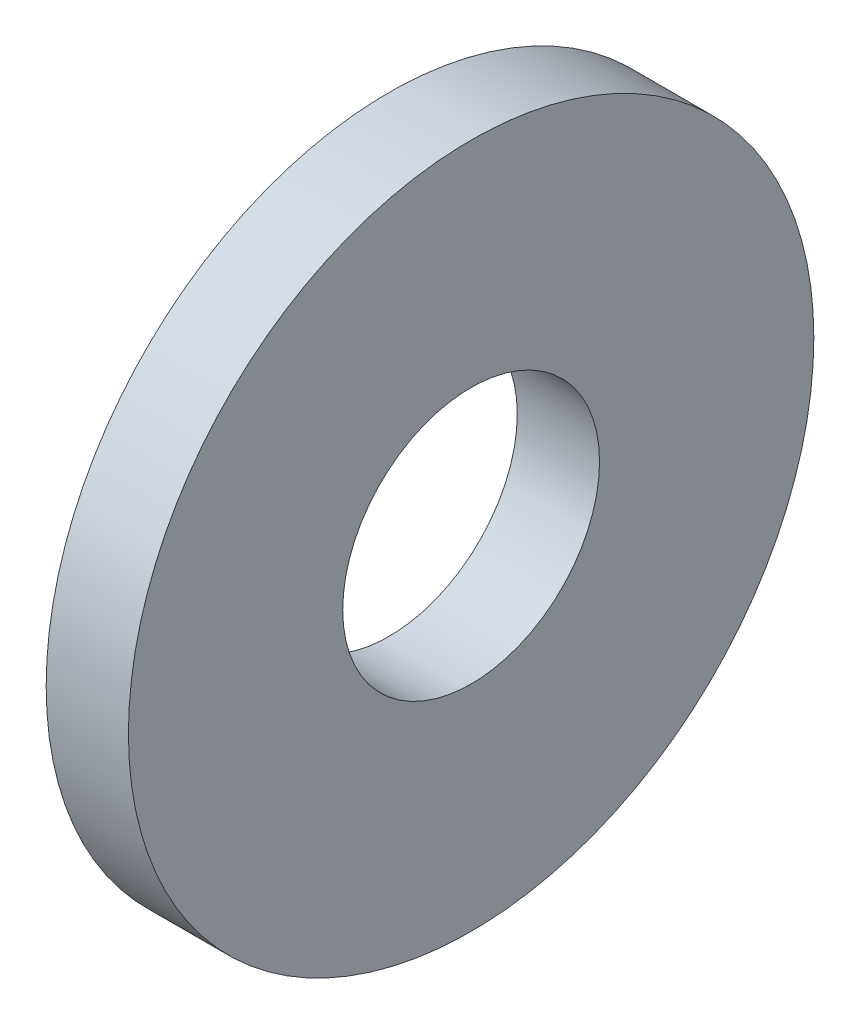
from build123d import *

# Parameters (mm, degrees)
SKETCH1_R           = 9.525
SKETCH1_R_2         = 3.5687
BOSS_EXTRUDE1_DEPTH = 2.286


with BuildPart() as part:
    # Sketch1 → Boss-Extrude1 (new body)
    with BuildSketch(Plane(origin=(0, 0, 0), x_dir=(0, 0, -1), z_dir=(1, 0, 0))):
        Circle(SKETCH1_R)
        Circle(SKETCH1_R_2, mode=Mode.SUBTRACT)
    extrude(amount=BOSS_EXTRUDE1_DEPTH)


solid = part.part
